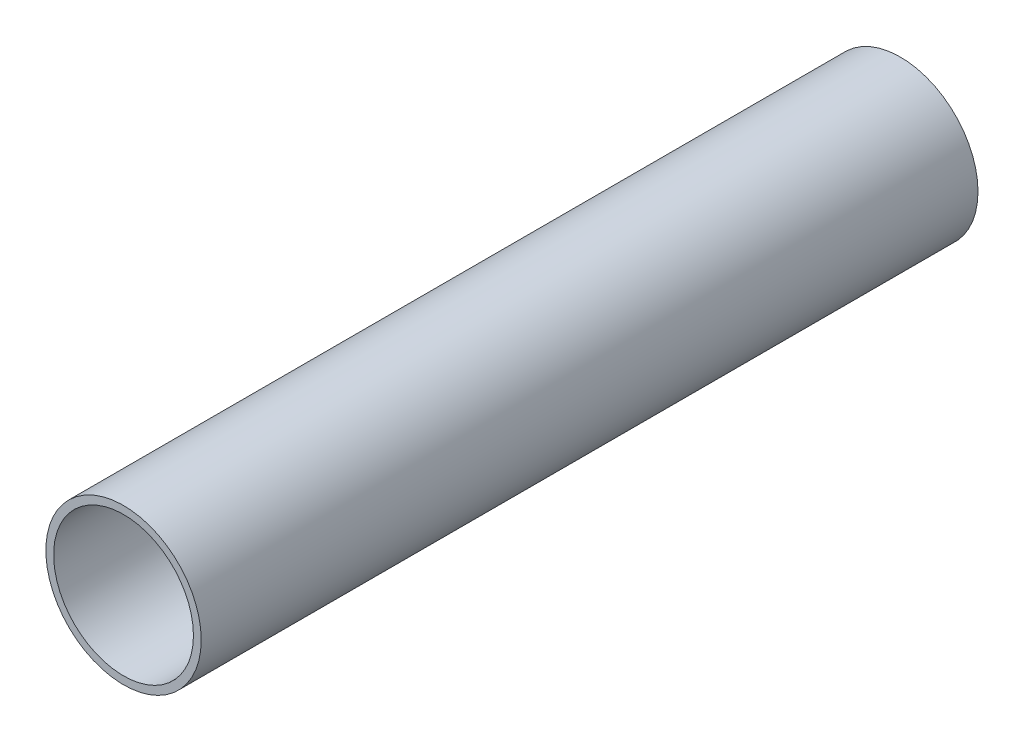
ISO-10303-21;
HEADER;
FILE_DESCRIPTION(('STEP AP214'),'2;1');
FILE_NAME('part.step','',(''),(''),'','','');
FILE_SCHEMA(('AUTOMOTIVE_DESIGN { 1 0 10303 214 1 1 1 1 }'));
ENDSEC;
DATA;
#1=APPLICATION_CONTEXT('core data for automotive mechanical design processes');
#2=APPLICATION_PROTOCOL_DEFINITION('international standard','automotive_design',2000,#1);
#3=PRODUCT_CONTEXT('',#1,'mechanical');
#4=PRODUCT('Part','Part','',(#3));
#5=PRODUCT_RELATED_PRODUCT_CATEGORY('part','',(#4));
#6=PRODUCT_DEFINITION_FORMATION('','',#4);
#7=PRODUCT_DEFINITION_CONTEXT('part definition',#1,'design');
#8=PRODUCT_DEFINITION('design','',#6,#7);
#9=PRODUCT_DEFINITION_SHAPE('','',#8);
#10=(LENGTH_UNIT() NAMED_UNIT(*) SI_UNIT(.MILLI.,.METRE.));
#11=(NAMED_UNIT(*) PLANE_ANGLE_UNIT() SI_UNIT($,.RADIAN.));
#12=(NAMED_UNIT(*) SI_UNIT($,.STERADIAN.) SOLID_ANGLE_UNIT());
#13=UNCERTAINTY_MEASURE_WITH_UNIT(LENGTH_MEASURE(1.E-05),#10,'distance_accuracy_value','');
#14=(GEOMETRIC_REPRESENTATION_CONTEXT(3) GLOBAL_UNCERTAINTY_ASSIGNED_CONTEXT((#13)) GLOBAL_UNIT_ASSIGNED_CONTEXT((#10,
#11,#12)) REPRESENTATION_CONTEXT('',''));
#15=CARTESIAN_POINT('',(0.,0.,0.));
#16=DIRECTION('',(0.,0.,1.));
#17=DIRECTION('',(1.,0.,0.));
#18=AXIS2_PLACEMENT_3D('',#15,#16,#17);
#19=CARTESIAN_POINT('',(0.,0.,150.));
#20=DIRECTION('',(0.,0.,1.));
#21=DIRECTION('',(1.,0.,0.));
#22=AXIS2_PLACEMENT_3D('',#19,#20,#21);
#23=PLANE('',#22);
#24=CARTESIAN_POINT('',(0.,0.,150.));
#25=DIRECTION('',(0.,0.,1.));
#26=DIRECTION('',(1.,0.,0.));
#27=AXIS2_PLACEMENT_3D('',#24,#25,#26);
#28=CIRCLE('',#27,15.);
#29=CARTESIAN_POINT('',(15.,0.,150.));
#30=VERTEX_POINT('',#29);
#31=EDGE_CURVE('E11',#30,#30,#28,.T.);
#32=ORIENTED_EDGE('',*,*,#31,.T.);
#33=EDGE_LOOP('',(#32));
#34=FACE_BOUND('',#33,.T.);
#35=CARTESIAN_POINT('',(0.,0.,150.));
#36=DIRECTION('',(0.,0.,1.));
#37=DIRECTION('',(1.,0.,0.));
#38=AXIS2_PLACEMENT_3D('',#35,#36,#37);
#39=CIRCLE('',#38,13.5);
#40=CARTESIAN_POINT('',(13.5,0.,150.));
#41=VERTEX_POINT('',#40);
#42=EDGE_CURVE('E45',#41,#41,#39,.T.);
#43=ORIENTED_EDGE('',*,*,#42,.F.);
#44=EDGE_LOOP('',(#43));
#45=FACE_BOUND('',#44,.T.);
#46=ADVANCED_FACE('F34',(#34,#45),#23,.T.);
#47=CARTESIAN_POINT('',(0.,0.,0.));
#48=DIRECTION('',(0.,0.,1.));
#49=DIRECTION('',(1.,0.,0.));
#50=AXIS2_PLACEMENT_3D('',#47,#48,#49);
#51=PLANE('',#50);
#52=CARTESIAN_POINT('',(0.,0.,0.));
#53=DIRECTION('',(0.,0.,1.));
#54=DIRECTION('',(1.,0.,0.));
#55=AXIS2_PLACEMENT_3D('',#52,#53,#54);
#56=CIRCLE('',#55,15.);
#57=CARTESIAN_POINT('',(15.,0.,0.));
#58=VERTEX_POINT('',#57);
#59=EDGE_CURVE('E38',#58,#58,#56,.T.);
#60=ORIENTED_EDGE('',*,*,#59,.F.);
#61=EDGE_LOOP('',(#60));
#62=FACE_BOUND('',#61,.T.);
#63=CARTESIAN_POINT('',(0.,0.,0.));
#64=DIRECTION('',(0.,0.,1.));
#65=DIRECTION('',(1.,0.,0.));
#66=AXIS2_PLACEMENT_3D('',#63,#64,#65);
#67=CIRCLE('',#66,13.5);
#68=CARTESIAN_POINT('',(13.5,0.,0.));
#69=VERTEX_POINT('',#68);
#70=EDGE_CURVE('E47',#69,#69,#67,.T.);
#71=ORIENTED_EDGE('',*,*,#70,.T.);
#72=EDGE_LOOP('',(#71));
#73=FACE_BOUND('',#72,.T.);
#74=ADVANCED_FACE('F57',(#62,#73),#51,.F.);
#75=CARTESIAN_POINT('',(0.,0.,150.));
#76=DIRECTION('',(0.,0.,-1.));
#77=DIRECTION('',(-1.,0.,0.));
#78=AXIS2_PLACEMENT_3D('',#75,#76,#77);
#79=CYLINDRICAL_SURFACE('',#78,15.);
#80=ORIENTED_EDGE('',*,*,#31,.F.);
#81=EDGE_LOOP('',(#80));
#82=FACE_BOUND('',#81,.T.);
#83=ORIENTED_EDGE('',*,*,#59,.T.);
#84=EDGE_LOOP('',(#83));
#85=FACE_BOUND('',#84,.T.);
#86=ADVANCED_FACE('F36',(#82,#85),#79,.T.);
#87=CARTESIAN_POINT('',(0.,0.,150.));
#88=DIRECTION('',(0.,0.,-1.));
#89=DIRECTION('',(-1.,0.,0.));
#90=AXIS2_PLACEMENT_3D('',#87,#88,#89);
#91=CYLINDRICAL_SURFACE('',#90,13.5);
#92=ORIENTED_EDGE('',*,*,#42,.T.);
#93=EDGE_LOOP('',(#92));
#94=FACE_BOUND('',#93,.T.);
#95=ORIENTED_EDGE('',*,*,#70,.F.);
#96=EDGE_LOOP('',(#95));
#97=FACE_BOUND('',#96,.T.);
#98=ADVANCED_FACE('F53',(#94,#97),#91,.F.);
#99=CLOSED_SHELL('',(#46,#74,#86,#98));
#100=MANIFOLD_SOLID_BREP('B2',#99);
#101=ADVANCED_BREP_SHAPE_REPRESENTATION('',(#18,#100),#14);
#102=SHAPE_DEFINITION_REPRESENTATION(#9,#101);
ENDSEC;
END-ISO-10303-21;
